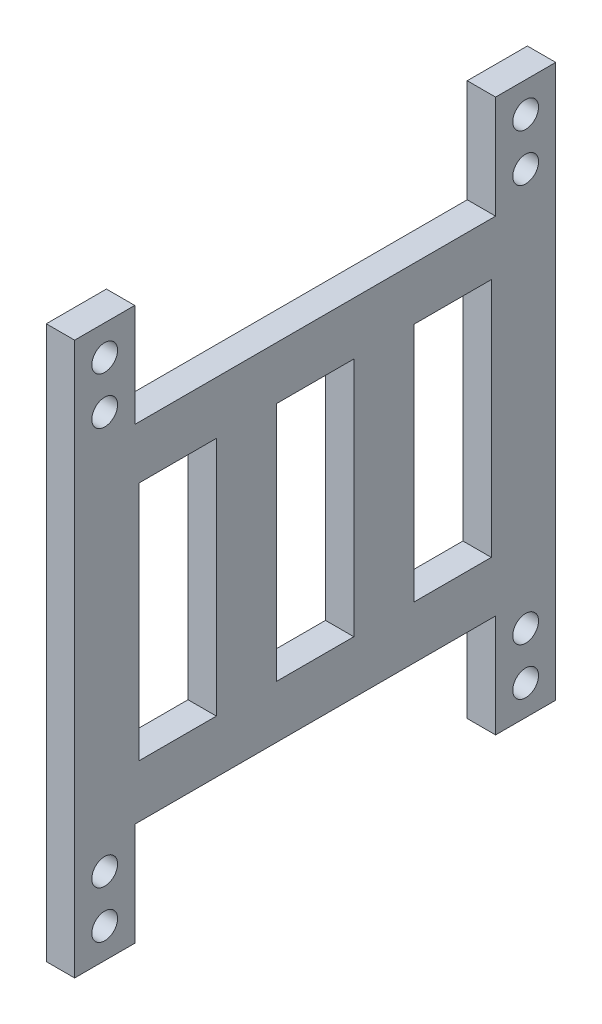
ISO-10303-21;
HEADER;
FILE_DESCRIPTION(('STEP AP214'),'2;1');
FILE_NAME('part.step','',(''),(''),'','','');
FILE_SCHEMA(('AUTOMOTIVE_DESIGN { 1 0 10303 214 1 1 1 1 }'));
ENDSEC;
DATA;
#1=APPLICATION_CONTEXT('core data for automotive mechanical design processes');
#2=APPLICATION_PROTOCOL_DEFINITION('international standard','automotive_design',2000,#1);
#3=PRODUCT_CONTEXT('',#1,'mechanical');
#4=PRODUCT('Part','Part','',(#3));
#5=PRODUCT_RELATED_PRODUCT_CATEGORY('part','',(#4));
#6=PRODUCT_DEFINITION_FORMATION('','',#4);
#7=PRODUCT_DEFINITION_CONTEXT('part definition',#1,'design');
#8=PRODUCT_DEFINITION('design','',#6,#7);
#9=PRODUCT_DEFINITION_SHAPE('','',#8);
#10=(LENGTH_UNIT() NAMED_UNIT(*) SI_UNIT(.MILLI.,.METRE.));
#11=(NAMED_UNIT(*) PLANE_ANGLE_UNIT() SI_UNIT($,.RADIAN.));
#12=(NAMED_UNIT(*) SI_UNIT($,.STERADIAN.) SOLID_ANGLE_UNIT());
#13=UNCERTAINTY_MEASURE_WITH_UNIT(LENGTH_MEASURE(1.E-05),#10,'distance_accuracy_value','');
#14=(GEOMETRIC_REPRESENTATION_CONTEXT(3) GLOBAL_UNCERTAINTY_ASSIGNED_CONTEXT((#13)) GLOBAL_UNIT_ASSIGNED_CONTEXT((#10,
#11,#12)) REPRESENTATION_CONTEXT('',''));
#15=CARTESIAN_POINT('',(0.,0.,0.));
#16=DIRECTION('',(0.,0.,1.));
#17=DIRECTION('',(1.,0.,0.));
#18=AXIS2_PLACEMENT_3D('',#15,#16,#17);
#19=CARTESIAN_POINT('',(3.3,-32.1500000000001,0.));
#20=DIRECTION('',(0.,-1.,0.));
#21=DIRECTION('',(0.,0.,-1.));
#22=AXIS2_PLACEMENT_3D('',#19,#20,#21);
#23=PLANE('',#22);
#24=DIRECTION('',(0.,0.,1.));
#25=VECTOR('',#24,1.);
#26=CARTESIAN_POINT('',(0.,-32.1500000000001,0.));
#27=LINE('',#26,#25);
#28=CARTESIAN_POINT('',(0.,-32.15,-28.));
#29=VERTEX_POINT('',#28);
#30=CARTESIAN_POINT('',(0.,-32.15,-21.));
#31=VERTEX_POINT('',#30);
#32=EDGE_CURVE('E264',#29,#31,#27,.T.);
#33=ORIENTED_EDGE('',*,*,#32,.F.);
#34=DIRECTION('',(-1.,0.,0.));
#35=VECTOR('',#34,1.);
#36=CARTESIAN_POINT('',(3.3,-32.15,-28.));
#37=LINE('',#36,#35);
#38=CARTESIAN_POINT('',(3.3,-32.15,-28.));
#39=VERTEX_POINT('',#38);
#40=EDGE_CURVE('E406',#39,#29,#37,.T.);
#41=ORIENTED_EDGE('',*,*,#40,.F.);
#42=DIRECTION('',(0.,0.,1.));
#43=VECTOR('',#42,1.);
#44=CARTESIAN_POINT('',(3.3,-32.1500000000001,0.));
#45=LINE('',#44,#43);
#46=CARTESIAN_POINT('',(3.3,-32.15,-21.));
#47=VERTEX_POINT('',#46);
#48=EDGE_CURVE('E271',#39,#47,#45,.T.);
#49=ORIENTED_EDGE('',*,*,#48,.T.);
#50=DIRECTION('',(-1.,0.,0.));
#51=VECTOR('',#50,1.);
#52=CARTESIAN_POINT('',(3.3,-32.15,-21.));
#53=LINE('',#52,#51);
#54=EDGE_CURVE('E326',#47,#31,#53,.T.);
#55=ORIENTED_EDGE('',*,*,#54,.T.);
#56=EDGE_LOOP('',(#33,#41,#49,#55));
#57=FACE_BOUND('',#56,.T.);
#58=ADVANCED_FACE('F39',(#57),#23,.T.);
#59=CARTESIAN_POINT('',(3.3,0.,-28.));
#60=DIRECTION('',(0.,0.,1.));
#61=DIRECTION('',(1.,0.,0.));
#62=AXIS2_PLACEMENT_3D('',#59,#60,#61);
#63=PLANE('',#62);
#64=DIRECTION('',(0.,1.,0.));
#65=VECTOR('',#64,1.);
#66=CARTESIAN_POINT('',(0.,0.,-28.));
#67=LINE('',#66,#65);
#68=CARTESIAN_POINT('',(0.,32.15,-28.));
#69=VERTEX_POINT('',#68);
#70=EDGE_CURVE('E329',#29,#69,#67,.T.);
#71=ORIENTED_EDGE('',*,*,#70,.T.);
#72=DIRECTION('',(-1.,0.,0.));
#73=VECTOR('',#72,1.);
#74=CARTESIAN_POINT('',(3.3,32.15,-28.));
#75=LINE('',#74,#73);
#76=CARTESIAN_POINT('',(3.3,32.15,-28.));
#77=VERTEX_POINT('',#76);
#78=EDGE_CURVE('E403',#77,#69,#75,.T.);
#79=ORIENTED_EDGE('',*,*,#78,.F.);
#80=DIRECTION('',(0.,1.,0.));
#81=VECTOR('',#80,1.);
#82=CARTESIAN_POINT('',(3.3,0.,-28.));
#83=LINE('',#82,#81);
#84=EDGE_CURVE('E274',#39,#77,#83,.T.);
#85=ORIENTED_EDGE('',*,*,#84,.F.);
#86=ORIENTED_EDGE('',*,*,#40,.T.);
#87=EDGE_LOOP('',(#71,#79,#85,#86));
#88=FACE_BOUND('',#87,.T.);
#89=ADVANCED_FACE('F463',(#88),#63,.F.);
#90=CARTESIAN_POINT('',(3.3,32.15,0.));
#91=DIRECTION('',(0.,-1.,0.));
#92=DIRECTION('',(0.,0.,-1.));
#93=AXIS2_PLACEMENT_3D('',#90,#91,#92);
#94=PLANE('',#93);
#95=DIRECTION('',(0.,0.,1.));
#96=VECTOR('',#95,1.);
#97=CARTESIAN_POINT('',(0.,32.15,0.));
#98=LINE('',#97,#96);
#99=CARTESIAN_POINT('',(0.,32.15,-21.));
#100=VERTEX_POINT('',#99);
#101=EDGE_CURVE('E331',#69,#100,#98,.T.);
#102=ORIENTED_EDGE('',*,*,#101,.T.);
#103=DIRECTION('',(-1.,0.,0.));
#104=VECTOR('',#103,1.);
#105=CARTESIAN_POINT('',(3.3,32.15,-21.));
#106=LINE('',#105,#104);
#107=CARTESIAN_POINT('',(3.3,32.15,-21.));
#108=VERTEX_POINT('',#107);
#109=EDGE_CURVE('E401',#108,#100,#106,.T.);
#110=ORIENTED_EDGE('',*,*,#109,.F.);
#111=DIRECTION('',(0.,0.,1.));
#112=VECTOR('',#111,1.);
#113=CARTESIAN_POINT('',(3.3,32.15,0.));
#114=LINE('',#113,#112);
#115=EDGE_CURVE('E277',#77,#108,#114,.T.);
#116=ORIENTED_EDGE('',*,*,#115,.F.);
#117=ORIENTED_EDGE('',*,*,#78,.T.);
#118=EDGE_LOOP('',(#102,#110,#116,#117));
#119=FACE_BOUND('',#118,.T.);
#120=ADVANCED_FACE('F468',(#119),#94,.F.);
#121=CARTESIAN_POINT('',(3.3,0.,-21.));
#122=DIRECTION('',(0.,0.,1.));
#123=DIRECTION('',(1.,0.,0.));
#124=AXIS2_PLACEMENT_3D('',#121,#122,#123);
#125=PLANE('',#124);
#126=DIRECTION('',(0.,1.,0.));
#127=VECTOR('',#126,1.);
#128=CARTESIAN_POINT('',(0.,0.,-21.));
#129=LINE('',#128,#127);
#130=CARTESIAN_POINT('',(0.,20.15,-21.));
#131=VERTEX_POINT('',#130);
#132=EDGE_CURVE('E334',#131,#100,#129,.T.);
#133=ORIENTED_EDGE('',*,*,#132,.F.);
#134=DIRECTION('',(-1.,0.,0.));
#135=VECTOR('',#134,1.);
#136=CARTESIAN_POINT('',(3.3,20.15,-21.));
#137=LINE('',#136,#135);
#138=CARTESIAN_POINT('',(3.3,20.15,-21.));
#139=VERTEX_POINT('',#138);
#140=EDGE_CURVE('E399',#139,#131,#137,.T.);
#141=ORIENTED_EDGE('',*,*,#140,.F.);
#142=DIRECTION('',(0.,1.,0.));
#143=VECTOR('',#142,1.);
#144=CARTESIAN_POINT('',(3.3,0.,-21.));
#145=LINE('',#144,#143);
#146=EDGE_CURVE('E279',#139,#108,#145,.T.);
#147=ORIENTED_EDGE('',*,*,#146,.T.);
#148=ORIENTED_EDGE('',*,*,#109,.T.);
#149=EDGE_LOOP('',(#133,#141,#147,#148));
#150=FACE_BOUND('',#149,.T.);
#151=ADVANCED_FACE('F521',(#150),#125,.T.);
#152=CARTESIAN_POINT('',(3.3,20.15,0.));
#153=DIRECTION('',(0.,1.,0.));
#154=DIRECTION('',(0.,0.,1.));
#155=AXIS2_PLACEMENT_3D('',#152,#153,#154);
#156=PLANE('',#155);
#157=DIRECTION('',(0.,0.,-1.));
#158=VECTOR('',#157,1.);
#159=CARTESIAN_POINT('',(0.,20.15,0.));
#160=LINE('',#159,#158);
#161=CARTESIAN_POINT('',(0.,20.15,21.));
#162=VERTEX_POINT('',#161);
#163=EDGE_CURVE('E337',#162,#131,#160,.T.);
#164=ORIENTED_EDGE('',*,*,#163,.F.);
#165=DIRECTION('',(-1.,0.,0.));
#166=VECTOR('',#165,1.);
#167=CARTESIAN_POINT('',(3.3,20.15,21.));
#168=LINE('',#167,#166);
#169=CARTESIAN_POINT('',(3.3,20.15,21.));
#170=VERTEX_POINT('',#169);
#171=EDGE_CURVE('E397',#170,#162,#168,.T.);
#172=ORIENTED_EDGE('',*,*,#171,.F.);
#173=DIRECTION('',(0.,0.,-1.));
#174=VECTOR('',#173,1.);
#175=CARTESIAN_POINT('',(3.3,20.15,0.));
#176=LINE('',#175,#174);
#177=EDGE_CURVE('E282',#170,#139,#176,.T.);
#178=ORIENTED_EDGE('',*,*,#177,.T.);
#179=ORIENTED_EDGE('',*,*,#140,.T.);
#180=EDGE_LOOP('',(#164,#172,#178,#179));
#181=FACE_BOUND('',#180,.T.);
#182=ADVANCED_FACE('F517',(#181),#156,.T.);
#183=CARTESIAN_POINT('',(3.3,0.,21.));
#184=DIRECTION('',(0.,0.,1.));
#185=DIRECTION('',(1.,0.,0.));
#186=AXIS2_PLACEMENT_3D('',#183,#184,#185);
#187=PLANE('',#186);
#188=DIRECTION('',(0.,1.,0.));
#189=VECTOR('',#188,1.);
#190=CARTESIAN_POINT('',(0.,0.,21.));
#191=LINE('',#190,#189);
#192=CARTESIAN_POINT('',(0.,32.15,21.));
#193=VERTEX_POINT('',#192);
#194=EDGE_CURVE('E340',#162,#193,#191,.T.);
#195=ORIENTED_EDGE('',*,*,#194,.T.);
#196=DIRECTION('',(-1.,0.,0.));
#197=VECTOR('',#196,1.);
#198=CARTESIAN_POINT('',(3.3,32.15,21.));
#199=LINE('',#198,#197);
#200=CARTESIAN_POINT('',(3.3,32.15,21.));
#201=VERTEX_POINT('',#200);
#202=EDGE_CURVE('E395',#201,#193,#199,.T.);
#203=ORIENTED_EDGE('',*,*,#202,.F.);
#204=DIRECTION('',(0.,1.,0.));
#205=VECTOR('',#204,1.);
#206=CARTESIAN_POINT('',(3.3,0.,21.));
#207=LINE('',#206,#205);
#208=EDGE_CURVE('E285',#170,#201,#207,.T.);
#209=ORIENTED_EDGE('',*,*,#208,.F.);
#210=ORIENTED_EDGE('',*,*,#171,.T.);
#211=EDGE_LOOP('',(#195,#203,#209,#210));
#212=FACE_BOUND('',#211,.T.);
#213=ADVANCED_FACE('F528',(#212),#187,.F.);
#214=CARTESIAN_POINT('',(3.3,32.15,0.));
#215=DIRECTION('',(0.,1.,0.));
#216=DIRECTION('',(0.,0.,1.));
#217=AXIS2_PLACEMENT_3D('',#214,#215,#216);
#218=PLANE('',#217);
#219=DIRECTION('',(0.,0.,-1.));
#220=VECTOR('',#219,1.);
#221=CARTESIAN_POINT('',(0.,32.15,0.));
#222=LINE('',#221,#220);
#223=CARTESIAN_POINT('',(0.,32.15,28.));
#224=VERTEX_POINT('',#223);
#225=EDGE_CURVE('E343',#224,#193,#222,.T.);
#226=ORIENTED_EDGE('',*,*,#225,.F.);
#227=DIRECTION('',(-1.,0.,0.));
#228=VECTOR('',#227,1.);
#229=CARTESIAN_POINT('',(3.3,32.15,28.));
#230=LINE('',#229,#228);
#231=CARTESIAN_POINT('',(3.3,32.15,28.));
#232=VERTEX_POINT('',#231);
#233=EDGE_CURVE('E393',#232,#224,#230,.T.);
#234=ORIENTED_EDGE('',*,*,#233,.F.);
#235=DIRECTION('',(0.,0.,-1.));
#236=VECTOR('',#235,1.);
#237=CARTESIAN_POINT('',(3.3,32.15,0.));
#238=LINE('',#237,#236);
#239=EDGE_CURVE('E287',#232,#201,#238,.T.);
#240=ORIENTED_EDGE('',*,*,#239,.T.);
#241=ORIENTED_EDGE('',*,*,#202,.T.);
#242=EDGE_LOOP('',(#226,#234,#240,#241));
#243=FACE_BOUND('',#242,.T.);
#244=ADVANCED_FACE('F511',(#243),#218,.T.);
#245=CARTESIAN_POINT('',(3.3,0.,28.));
#246=DIRECTION('',(0.,0.,1.));
#247=DIRECTION('',(0.,-1.,0.));
#248=AXIS2_PLACEMENT_3D('',#245,#246,#247);
#249=PLANE('',#248);
#250=DIRECTION('',(0.,1.,0.));
#251=VECTOR('',#250,1.);
#252=CARTESIAN_POINT('',(0.,0.,28.));
#253=LINE('',#252,#251);
#254=CARTESIAN_POINT('',(0.,-32.15,28.));
#255=VERTEX_POINT('',#254);
#256=EDGE_CURVE('E346',#255,#224,#253,.T.);
#257=ORIENTED_EDGE('',*,*,#256,.F.);
#258=DIRECTION('',(-1.,0.,0.));
#259=VECTOR('',#258,1.);
#260=CARTESIAN_POINT('',(3.3,-32.15,28.));
#261=LINE('',#260,#259);
#262=CARTESIAN_POINT('',(3.3,-32.15,28.));
#263=VERTEX_POINT('',#262);
#264=EDGE_CURVE('E391',#263,#255,#261,.T.);
#265=ORIENTED_EDGE('',*,*,#264,.F.);
#266=DIRECTION('',(0.,1.,0.));
#267=VECTOR('',#266,1.);
#268=CARTESIAN_POINT('',(3.3,0.,28.));
#269=LINE('',#268,#267);
#270=EDGE_CURVE('E290',#263,#232,#269,.T.);
#271=ORIENTED_EDGE('',*,*,#270,.T.);
#272=ORIENTED_EDGE('',*,*,#233,.T.);
#273=EDGE_LOOP('',(#257,#265,#271,#272));
#274=FACE_BOUND('',#273,.T.);
#275=ADVANCED_FACE('F506',(#274),#249,.T.);
#276=CARTESIAN_POINT('',(3.3,-32.15,0.));
#277=DIRECTION('',(0.,1.,0.));
#278=DIRECTION('',(0.,0.,1.));
#279=AXIS2_PLACEMENT_3D('',#276,#277,#278);
#280=PLANE('',#279);
#281=DIRECTION('',(0.,0.,-1.));
#282=VECTOR('',#281,1.);
#283=CARTESIAN_POINT('',(0.,-32.15,0.));
#284=LINE('',#283,#282);
#285=CARTESIAN_POINT('',(0.,-32.15,21.));
#286=VERTEX_POINT('',#285);
#287=EDGE_CURVE('E349',#255,#286,#284,.T.);
#288=ORIENTED_EDGE('',*,*,#287,.T.);
#289=DIRECTION('',(-1.,0.,0.));
#290=VECTOR('',#289,1.);
#291=CARTESIAN_POINT('',(3.3,-32.15,21.));
#292=LINE('',#291,#290);
#293=CARTESIAN_POINT('',(3.3,-32.15,21.));
#294=VERTEX_POINT('',#293);
#295=EDGE_CURVE('E389',#294,#286,#292,.T.);
#296=ORIENTED_EDGE('',*,*,#295,.F.);
#297=DIRECTION('',(0.,0.,-1.));
#298=VECTOR('',#297,1.);
#299=CARTESIAN_POINT('',(3.3,-32.15,0.));
#300=LINE('',#299,#298);
#301=EDGE_CURVE('E293',#263,#294,#300,.T.);
#302=ORIENTED_EDGE('',*,*,#301,.F.);
#303=ORIENTED_EDGE('',*,*,#264,.T.);
#304=EDGE_LOOP('',(#288,#296,#302,#303));
#305=FACE_BOUND('',#304,.T.);
#306=ADVANCED_FACE('F503',(#305),#280,.F.);
#307=CARTESIAN_POINT('',(3.3,0.,21.));
#308=DIRECTION('',(0.,0.,-1.));
#309=DIRECTION('',(0.,1.,0.));
#310=AXIS2_PLACEMENT_3D('',#307,#308,#309);
#311=PLANE('',#310);
#312=DIRECTION('',(0.,-1.,0.));
#313=VECTOR('',#312,1.);
#314=CARTESIAN_POINT('',(0.,0.,21.));
#315=LINE('',#314,#313);
#316=CARTESIAN_POINT('',(0.,-20.15,21.));
#317=VERTEX_POINT('',#316);
#318=EDGE_CURVE('E352',#317,#286,#315,.T.);
#319=ORIENTED_EDGE('',*,*,#318,.F.);
#320=DIRECTION('',(-1.,0.,0.));
#321=VECTOR('',#320,1.);
#322=CARTESIAN_POINT('',(3.3,-20.15,21.));
#323=LINE('',#322,#321);
#324=CARTESIAN_POINT('',(3.3,-20.15,21.));
#325=VERTEX_POINT('',#324);
#326=EDGE_CURVE('E387',#325,#317,#323,.T.);
#327=ORIENTED_EDGE('',*,*,#326,.F.);
#328=DIRECTION('',(0.,-1.,0.));
#329=VECTOR('',#328,1.);
#330=CARTESIAN_POINT('',(3.3,0.,21.));
#331=LINE('',#330,#329);
#332=EDGE_CURVE('E295',#325,#294,#331,.T.);
#333=ORIENTED_EDGE('',*,*,#332,.T.);
#334=ORIENTED_EDGE('',*,*,#295,.T.);
#335=EDGE_LOOP('',(#319,#327,#333,#334));
#336=FACE_BOUND('',#335,.T.);
#337=ADVANCED_FACE('F499',(#336),#311,.T.);
#338=CARTESIAN_POINT('',(3.3,-20.15,0.));
#339=DIRECTION('',(0.,1.,0.));
#340=DIRECTION('',(0.,0.,1.));
#341=AXIS2_PLACEMENT_3D('',#338,#339,#340);
#342=PLANE('',#341);
#343=DIRECTION('',(0.,0.,-1.));
#344=VECTOR('',#343,1.);
#345=CARTESIAN_POINT('',(0.,-20.15,0.));
#346=LINE('',#345,#344);
#347=CARTESIAN_POINT('',(0.,-20.15,-21.));
#348=VERTEX_POINT('',#347);
#349=EDGE_CURVE('E355',#317,#348,#346,.T.);
#350=ORIENTED_EDGE('',*,*,#349,.T.);
#351=DIRECTION('',(-1.,0.,0.));
#352=VECTOR('',#351,1.);
#353=CARTESIAN_POINT('',(3.3,-20.15,-21.));
#354=LINE('',#353,#352);
#355=CARTESIAN_POINT('',(3.3,-20.15,-21.));
#356=VERTEX_POINT('',#355);
#357=EDGE_CURVE('E384',#356,#348,#354,.T.);
#358=ORIENTED_EDGE('',*,*,#357,.F.);
#359=DIRECTION('',(0.,0.,-1.));
#360=VECTOR('',#359,1.);
#361=CARTESIAN_POINT('',(3.3,-20.15,0.));
#362=LINE('',#361,#360);
#363=EDGE_CURVE('E298',#325,#356,#362,.T.);
#364=ORIENTED_EDGE('',*,*,#363,.F.);
#365=ORIENTED_EDGE('',*,*,#326,.T.);
#366=EDGE_LOOP('',(#350,#358,#364,#365));
#367=FACE_BOUND('',#366,.T.);
#368=ADVANCED_FACE('F495',(#367),#342,.F.);
#369=CARTESIAN_POINT('',(3.3,-28.65,-24.5));
#370=DIRECTION('',(-1.,0.,0.));
#371=DIRECTION('',(0.,0.,1.));
#372=AXIS2_PLACEMENT_3D('',#369,#370,#371);
#373=CYLINDRICAL_SURFACE('',#372,1.5);
#374=CARTESIAN_POINT('',(3.3,-28.65,-24.5));
#375=DIRECTION('',(1.,0.,0.));
#376=DIRECTION('',(0.,0.,-1.));
#377=AXIS2_PLACEMENT_3D('',#374,#375,#376);
#378=CIRCLE('',#377,1.5);
#379=CARTESIAN_POINT('',(3.3,-28.65,-26.));
#380=VERTEX_POINT('',#379);
#381=EDGE_CURVE('E320',#380,#380,#378,.T.);
#382=ORIENTED_EDGE('',*,*,#381,.T.);
#383=EDGE_LOOP('',(#382));
#384=FACE_BOUND('',#383,.T.);
#385=CARTESIAN_POINT('',(0.,-28.65,-24.5));
#386=DIRECTION('',(1.,0.,0.));
#387=DIRECTION('',(0.,0.,-1.));
#388=AXIS2_PLACEMENT_3D('',#385,#386,#387);
#389=CIRCLE('',#388,1.5);
#390=CARTESIAN_POINT('',(0.,-28.65,-26.));
#391=VERTEX_POINT('',#390);
#392=EDGE_CURVE('E378',#391,#391,#389,.T.);
#393=ORIENTED_EDGE('',*,*,#392,.F.);
#394=EDGE_LOOP('',(#393));
#395=FACE_BOUND('',#394,.T.);
#396=ADVANCED_FACE('F544',(#384,#395),#373,.F.);
#397=CARTESIAN_POINT('',(3.3,28.65,-24.5));
#398=DIRECTION('',(-1.,0.,0.));
#399=DIRECTION('',(0.,0.,1.));
#400=AXIS2_PLACEMENT_3D('',#397,#398,#399);
#401=CYLINDRICAL_SURFACE('',#400,1.5);
#402=CARTESIAN_POINT('',(3.3,28.65,-24.5));
#403=DIRECTION('',(1.,0.,0.));
#404=DIRECTION('',(0.,0.,-1.));
#405=AXIS2_PLACEMENT_3D('',#402,#403,#404);
#406=CIRCLE('',#405,1.5);
#407=CARTESIAN_POINT('',(3.3,28.65,-26.));
#408=VERTEX_POINT('',#407);
#409=EDGE_CURVE('E317',#408,#408,#406,.F.);
#410=ORIENTED_EDGE('',*,*,#409,.F.);
#411=EDGE_LOOP('',(#410));
#412=FACE_BOUND('',#411,.T.);
#413=CARTESIAN_POINT('',(0.,28.65,-24.5));
#414=DIRECTION('',(1.,0.,0.));
#415=DIRECTION('',(0.,0.,-1.));
#416=AXIS2_PLACEMENT_3D('',#413,#414,#415);
#417=CIRCLE('',#416,1.5);
#418=CARTESIAN_POINT('',(0.,28.65,-26.));
#419=VERTEX_POINT('',#418);
#420=EDGE_CURVE('E375',#419,#419,#417,.F.);
#421=ORIENTED_EDGE('',*,*,#420,.T.);
#422=EDGE_LOOP('',(#421));
#423=FACE_BOUND('',#422,.T.);
#424=ADVANCED_FACE('F567',(#412,#423),#401,.F.);
#425=CARTESIAN_POINT('',(3.3,23.15,-24.5));
#426=DIRECTION('',(-1.,0.,0.));
#427=DIRECTION('',(0.,0.,1.));
#428=AXIS2_PLACEMENT_3D('',#425,#426,#427);
#429=CYLINDRICAL_SURFACE('',#428,1.5);
#430=CARTESIAN_POINT('',(3.3,23.15,-24.5));
#431=DIRECTION('',(1.,0.,0.));
#432=DIRECTION('',(0.,0.,-1.));
#433=AXIS2_PLACEMENT_3D('',#430,#431,#432);
#434=CIRCLE('',#433,1.5);
#435=CARTESIAN_POINT('',(3.3,23.15,-26.));
#436=VERTEX_POINT('',#435);
#437=EDGE_CURVE('E314',#436,#436,#434,.F.);
#438=ORIENTED_EDGE('',*,*,#437,.F.);
#439=EDGE_LOOP('',(#438));
#440=FACE_BOUND('',#439,.T.);
#441=CARTESIAN_POINT('',(0.,23.15,-24.5));
#442=DIRECTION('',(1.,0.,0.));
#443=DIRECTION('',(0.,0.,-1.));
#444=AXIS2_PLACEMENT_3D('',#441,#442,#443);
#445=CIRCLE('',#444,1.5);
#446=CARTESIAN_POINT('',(0.,23.15,-26.));
#447=VERTEX_POINT('',#446);
#448=EDGE_CURVE('E372',#447,#447,#445,.F.);
#449=ORIENTED_EDGE('',*,*,#448,.T.);
#450=EDGE_LOOP('',(#449));
#451=FACE_BOUND('',#450,.T.);
#452=ADVANCED_FACE('F563',(#440,#451),#429,.F.);
#453=CARTESIAN_POINT('',(3.3,-28.65,24.5));
#454=DIRECTION('',(-1.,0.,0.));
#455=DIRECTION('',(0.,0.,1.));
#456=AXIS2_PLACEMENT_3D('',#453,#454,#455);
#457=CYLINDRICAL_SURFACE('',#456,1.5);
#458=CARTESIAN_POINT('',(3.3,-28.65,24.5));
#459=DIRECTION('',(1.,0.,0.));
#460=DIRECTION('',(0.,0.,-1.));
#461=AXIS2_PLACEMENT_3D('',#458,#459,#460);
#462=CIRCLE('',#461,1.5);
#463=CARTESIAN_POINT('',(3.3,-28.65,23.));
#464=VERTEX_POINT('',#463);
#465=EDGE_CURVE('E311',#464,#464,#462,.F.);
#466=ORIENTED_EDGE('',*,*,#465,.F.);
#467=EDGE_LOOP('',(#466));
#468=FACE_BOUND('',#467,.T.);
#469=CARTESIAN_POINT('',(0.,-28.65,24.5));
#470=DIRECTION('',(1.,0.,0.));
#471=DIRECTION('',(0.,0.,-1.));
#472=AXIS2_PLACEMENT_3D('',#469,#470,#471);
#473=CIRCLE('',#472,1.5);
#474=CARTESIAN_POINT('',(0.,-28.65,23.));
#475=VERTEX_POINT('',#474);
#476=EDGE_CURVE('E369',#475,#475,#473,.F.);
#477=ORIENTED_EDGE('',*,*,#476,.T.);
#478=EDGE_LOOP('',(#477));
#479=FACE_BOUND('',#478,.T.);
#480=ADVANCED_FACE('F559',(#468,#479),#457,.F.);
#481=CARTESIAN_POINT('',(3.3,-23.15,24.5));
#482=DIRECTION('',(-1.,0.,0.));
#483=DIRECTION('',(0.,0.,1.));
#484=AXIS2_PLACEMENT_3D('',#481,#482,#483);
#485=CYLINDRICAL_SURFACE('',#484,1.5);
#486=CARTESIAN_POINT('',(3.3,-23.15,24.5));
#487=DIRECTION('',(1.,0.,0.));
#488=DIRECTION('',(0.,0.,-1.));
#489=AXIS2_PLACEMENT_3D('',#486,#487,#488);
#490=CIRCLE('',#489,1.5);
#491=CARTESIAN_POINT('',(3.3,-23.15,23.));
#492=VERTEX_POINT('',#491);
#493=EDGE_CURVE('E308',#492,#492,#490,.F.);
#494=ORIENTED_EDGE('',*,*,#493,.F.);
#495=EDGE_LOOP('',(#494));
#496=FACE_BOUND('',#495,.T.);
#497=CARTESIAN_POINT('',(0.,-23.15,24.5));
#498=DIRECTION('',(1.,0.,0.));
#499=DIRECTION('',(0.,0.,-1.));
#500=AXIS2_PLACEMENT_3D('',#497,#498,#499);
#501=CIRCLE('',#500,1.5);
#502=CARTESIAN_POINT('',(0.,-23.15,23.));
#503=VERTEX_POINT('',#502);
#504=EDGE_CURVE('E366',#503,#503,#501,.F.);
#505=ORIENTED_EDGE('',*,*,#504,.T.);
#506=EDGE_LOOP('',(#505));
#507=FACE_BOUND('',#506,.T.);
#508=ADVANCED_FACE('F555',(#496,#507),#485,.F.);
#509=CARTESIAN_POINT('',(3.3,28.65,24.5));
#510=DIRECTION('',(-1.,0.,0.));
#511=DIRECTION('',(0.,0.,1.));
#512=AXIS2_PLACEMENT_3D('',#509,#510,#511);
#513=CYLINDRICAL_SURFACE('',#512,1.5);
#514=CARTESIAN_POINT('',(3.3,28.65,24.5));
#515=DIRECTION('',(1.,0.,0.));
#516=DIRECTION('',(0.,0.,-1.));
#517=AXIS2_PLACEMENT_3D('',#514,#515,#516);
#518=CIRCLE('',#517,1.5);
#519=CARTESIAN_POINT('',(3.3,28.65,23.));
#520=VERTEX_POINT('',#519);
#521=EDGE_CURVE('E305',#520,#520,#518,.T.);
#522=ORIENTED_EDGE('',*,*,#521,.T.);
#523=EDGE_LOOP('',(#522));
#524=FACE_BOUND('',#523,.T.);
#525=CARTESIAN_POINT('',(0.,28.65,24.5));
#526=DIRECTION('',(1.,0.,0.));
#527=DIRECTION('',(0.,0.,-1.));
#528=AXIS2_PLACEMENT_3D('',#525,#526,#527);
#529=CIRCLE('',#528,1.5);
#530=CARTESIAN_POINT('',(0.,28.65,23.));
#531=VERTEX_POINT('',#530);
#532=EDGE_CURVE('E363',#531,#531,#529,.T.);
#533=ORIENTED_EDGE('',*,*,#532,.F.);
#534=EDGE_LOOP('',(#533));
#535=FACE_BOUND('',#534,.T.);
#536=ADVANCED_FACE('F551',(#524,#535),#513,.F.);
#537=CARTESIAN_POINT('',(3.3,23.15,24.5));
#538=DIRECTION('',(-1.,0.,0.));
#539=DIRECTION('',(0.,0.,1.));
#540=AXIS2_PLACEMENT_3D('',#537,#538,#539);
#541=CYLINDRICAL_SURFACE('',#540,1.5);
#542=CARTESIAN_POINT('',(3.3,23.15,24.5));
#543=DIRECTION('',(1.,0.,0.));
#544=DIRECTION('',(0.,0.,-1.));
#545=AXIS2_PLACEMENT_3D('',#542,#543,#544);
#546=CIRCLE('',#545,1.5);
#547=CARTESIAN_POINT('',(3.3,23.15,23.));
#548=VERTEX_POINT('',#547);
#549=EDGE_CURVE('E302',#548,#548,#546,.T.);
#550=ORIENTED_EDGE('',*,*,#549,.T.);
#551=EDGE_LOOP('',(#550));
#552=FACE_BOUND('',#551,.T.);
#553=CARTESIAN_POINT('',(0.,23.15,24.5));
#554=DIRECTION('',(1.,0.,0.));
#555=DIRECTION('',(0.,0.,-1.));
#556=AXIS2_PLACEMENT_3D('',#553,#554,#555);
#557=CIRCLE('',#556,1.5);
#558=CARTESIAN_POINT('',(0.,23.15,23.));
#559=VERTEX_POINT('',#558);
#560=EDGE_CURVE('E360',#559,#559,#557,.T.);
#561=ORIENTED_EDGE('',*,*,#560,.F.);
#562=EDGE_LOOP('',(#561));
#563=FACE_BOUND('',#562,.T.);
#564=ADVANCED_FACE('F548',(#552,#563),#541,.F.);
#565=CARTESIAN_POINT('',(3.3,0.,-21.));
#566=DIRECTION('',(0.,0.,-1.));
#567=DIRECTION('',(-1.,0.,0.));
#568=AXIS2_PLACEMENT_3D('',#565,#566,#567);
#569=PLANE('',#568);
#570=DIRECTION('',(0.,-1.,0.));
#571=VECTOR('',#570,1.);
#572=CARTESIAN_POINT('',(0.,0.,-21.));
#573=LINE('',#572,#571);
#574=EDGE_CURVE('E357',#348,#31,#573,.T.);
#575=ORIENTED_EDGE('',*,*,#574,.T.);
#576=ORIENTED_EDGE('',*,*,#54,.F.);
#577=DIRECTION('',(0.,-1.,0.));
#578=VECTOR('',#577,1.);
#579=CARTESIAN_POINT('',(3.3,0.,-21.));
#580=LINE('',#579,#578);
#581=EDGE_CURVE('E300',#356,#47,#580,.T.);
#582=ORIENTED_EDGE('',*,*,#581,.F.);
#583=ORIENTED_EDGE('',*,*,#357,.T.);
#584=EDGE_LOOP('',(#575,#576,#582,#583));
#585=FACE_BOUND('',#584,.T.);
#586=ADVANCED_FACE('F493',(#585),#569,.F.);
#587=CARTESIAN_POINT('',(3.3,-23.15,-24.5));
#588=DIRECTION('',(-1.,0.,0.));
#589=DIRECTION('',(0.,0.,1.));
#590=AXIS2_PLACEMENT_3D('',#587,#588,#589);
#591=CYLINDRICAL_SURFACE('',#590,1.5);
#592=CARTESIAN_POINT('',(3.3,-23.15,-24.5));
#593=DIRECTION('',(1.,0.,0.));
#594=DIRECTION('',(0.,0.,-1.));
#595=AXIS2_PLACEMENT_3D('',#592,#593,#594);
#596=CIRCLE('',#595,1.5);
#597=CARTESIAN_POINT('',(3.3,-23.15,-26.));
#598=VERTEX_POINT('',#597);
#599=EDGE_CURVE('E323',#598,#598,#596,.T.);
#600=ORIENTED_EDGE('',*,*,#599,.T.);
#601=EDGE_LOOP('',(#600));
#602=FACE_BOUND('',#601,.T.);
#603=CARTESIAN_POINT('',(0.,-23.15,-24.5));
#604=DIRECTION('',(1.,0.,0.));
#605=DIRECTION('',(0.,0.,-1.));
#606=AXIS2_PLACEMENT_3D('',#603,#604,#605);
#607=CIRCLE('',#606,1.5);
#608=CARTESIAN_POINT('',(0.,-23.15,-26.));
#609=VERTEX_POINT('',#608);
#610=EDGE_CURVE('E275',#609,#609,#607,.T.);
#611=ORIENTED_EDGE('',*,*,#610,.F.);
#612=EDGE_LOOP('',(#611));
#613=FACE_BOUND('',#612,.T.);
#614=ADVANCED_FACE('F547',(#602,#613),#591,.F.);
#615=CARTESIAN_POINT('',(3.3,0.,0.));
#616=DIRECTION('',(1.,0.,0.));
#617=DIRECTION('',(0.,0.,-1.));
#618=AXIS2_PLACEMENT_3D('',#615,#616,#617);
#619=PLANE('',#618);
#620=DIRECTION('',(0.,1.,0.));
#621=VECTOR('',#620,1.);
#622=CARTESIAN_POINT('',(3.3,-14.,-20.5));
#623=LINE('',#622,#621);
#624=CARTESIAN_POINT('',(3.3,-14.,-20.5));
#625=VERTEX_POINT('',#624);
#626=CARTESIAN_POINT('',(3.3,14.,-20.5));
#627=VERTEX_POINT('',#626);
#628=EDGE_CURVE('E53',#625,#627,#623,.T.);
#629=ORIENTED_EDGE('',*,*,#628,.F.);
#630=DIRECTION('',(0.,0.,-1.));
#631=VECTOR('',#630,1.);
#632=CARTESIAN_POINT('',(3.3,-14.,-11.5));
#633=LINE('',#632,#631);
#634=CARTESIAN_POINT('',(3.3,-14.,-11.5));
#635=VERTEX_POINT('',#634);
#636=EDGE_CURVE('E240',#635,#625,#633,.T.);
#637=ORIENTED_EDGE('',*,*,#636,.F.);
#638=DIRECTION('',(0.,-1.,0.));
#639=VECTOR('',#638,1.);
#640=CARTESIAN_POINT('',(3.3,-14.,-11.5));
#641=LINE('',#640,#639);
#642=CARTESIAN_POINT('',(3.3,14.,-11.5));
#643=VERTEX_POINT('',#642);
#644=EDGE_CURVE('E237',#643,#635,#641,.T.);
#645=ORIENTED_EDGE('',*,*,#644,.F.);
#646=DIRECTION('',(0.,0.,1.));
#647=VECTOR('',#646,1.);
#648=CARTESIAN_POINT('',(3.3,14.,-11.5));
#649=LINE('',#648,#647);
#650=EDGE_CURVE('E234',#627,#643,#649,.T.);
#651=ORIENTED_EDGE('',*,*,#650,.F.);
#652=EDGE_LOOP('',(#629,#637,#645,#651));
#653=FACE_BOUND('',#652,.T.);
#654=DIRECTION('',(0.,1.,0.));
#655=VECTOR('',#654,1.);
#656=CARTESIAN_POINT('',(3.3,-14.,11.5));
#657=LINE('',#656,#655);
#658=CARTESIAN_POINT('',(3.3,-14.,11.5));
#659=VERTEX_POINT('',#658);
#660=CARTESIAN_POINT('',(3.3,14.,11.5));
#661=VERTEX_POINT('',#660);
#662=EDGE_CURVE('E61',#659,#661,#657,.T.);
#663=ORIENTED_EDGE('',*,*,#662,.F.);
#664=DIRECTION('',(0.,0.,-1.));
#665=VECTOR('',#664,1.);
#666=CARTESIAN_POINT('',(3.3,-14.,20.5));
#667=LINE('',#666,#665);
#668=CARTESIAN_POINT('',(3.3,-14.,20.5));
#669=VERTEX_POINT('',#668);
#670=EDGE_CURVE('E223',#669,#659,#667,.T.);
#671=ORIENTED_EDGE('',*,*,#670,.F.);
#672=DIRECTION('',(0.,-1.,0.));
#673=VECTOR('',#672,1.);
#674=CARTESIAN_POINT('',(3.3,-14.,20.5));
#675=LINE('',#674,#673);
#676=CARTESIAN_POINT('',(3.3,14.,20.5));
#677=VERTEX_POINT('',#676);
#678=EDGE_CURVE('E206',#677,#669,#675,.T.);
#679=ORIENTED_EDGE('',*,*,#678,.F.);
#680=DIRECTION('',(0.,0.,1.));
#681=VECTOR('',#680,1.);
#682=CARTESIAN_POINT('',(3.3,14.,20.5));
#683=LINE('',#682,#681);
#684=EDGE_CURVE('E216',#661,#677,#683,.T.);
#685=ORIENTED_EDGE('',*,*,#684,.F.);
#686=EDGE_LOOP('',(#663,#671,#679,#685));
#687=FACE_BOUND('',#686,.T.);
#688=DIRECTION('',(0.,1.,0.));
#689=VECTOR('',#688,1.);
#690=CARTESIAN_POINT('',(3.3,-14.,-4.5));
#691=LINE('',#690,#689);
#692=CARTESIAN_POINT('',(3.3,-14.,-4.5));
#693=VERTEX_POINT('',#692);
#694=CARTESIAN_POINT('',(3.3,14.,-4.5));
#695=VERTEX_POINT('',#694);
#696=EDGE_CURVE('E230',#693,#695,#691,.T.);
#697=ORIENTED_EDGE('',*,*,#696,.F.);
#698=DIRECTION('',(0.,0.,-1.));
#699=VECTOR('',#698,1.);
#700=CARTESIAN_POINT('',(3.3,-14.,4.5));
#701=LINE('',#700,#699);
#702=CARTESIAN_POINT('',(3.3,-14.,4.5));
#703=VERTEX_POINT('',#702);
#704=EDGE_CURVE('E258',#703,#693,#701,.T.);
#705=ORIENTED_EDGE('',*,*,#704,.F.);
#706=DIRECTION('',(0.,-1.,0.));
#707=VECTOR('',#706,1.);
#708=CARTESIAN_POINT('',(3.3,-14.,4.5));
#709=LINE('',#708,#707);
#710=CARTESIAN_POINT('',(3.3,14.,4.5));
#711=VERTEX_POINT('',#710);
#712=EDGE_CURVE('E255',#711,#703,#709,.T.);
#713=ORIENTED_EDGE('',*,*,#712,.F.);
#714=DIRECTION('',(0.,0.,1.));
#715=VECTOR('',#714,1.);
#716=CARTESIAN_POINT('',(3.3,14.,4.5));
#717=LINE('',#716,#715);
#718=EDGE_CURVE('E252',#695,#711,#717,.T.);
#719=ORIENTED_EDGE('',*,*,#718,.F.);
#720=EDGE_LOOP('',(#697,#705,#713,#719));
#721=FACE_BOUND('',#720,.T.);
#722=ORIENTED_EDGE('',*,*,#48,.F.);
#723=ORIENTED_EDGE('',*,*,#84,.T.);
#724=ORIENTED_EDGE('',*,*,#115,.T.);
#725=ORIENTED_EDGE('',*,*,#146,.F.);
#726=ORIENTED_EDGE('',*,*,#177,.F.);
#727=ORIENTED_EDGE('',*,*,#208,.T.);
#728=ORIENTED_EDGE('',*,*,#239,.F.);
#729=ORIENTED_EDGE('',*,*,#270,.F.);
#730=ORIENTED_EDGE('',*,*,#301,.T.);
#731=ORIENTED_EDGE('',*,*,#332,.F.);
#732=ORIENTED_EDGE('',*,*,#363,.T.);
#733=ORIENTED_EDGE('',*,*,#581,.T.);
#734=EDGE_LOOP('',(#722,#723,#724,#725,#726,#727,#728,#729,#730,#731,#732,#733));
#735=FACE_BOUND('',#734,.T.);
#736=ORIENTED_EDGE('',*,*,#549,.F.);
#737=EDGE_LOOP('',(#736));
#738=FACE_BOUND('',#737,.T.);
#739=ORIENTED_EDGE('',*,*,#521,.F.);
#740=EDGE_LOOP('',(#739));
#741=FACE_BOUND('',#740,.T.);
#742=ORIENTED_EDGE('',*,*,#493,.T.);
#743=EDGE_LOOP('',(#742));
#744=FACE_BOUND('',#743,.T.);
#745=ORIENTED_EDGE('',*,*,#465,.T.);
#746=EDGE_LOOP('',(#745));
#747=FACE_BOUND('',#746,.T.);
#748=ORIENTED_EDGE('',*,*,#437,.T.);
#749=EDGE_LOOP('',(#748));
#750=FACE_BOUND('',#749,.T.);
#751=ORIENTED_EDGE('',*,*,#409,.T.);
#752=EDGE_LOOP('',(#751));
#753=FACE_BOUND('',#752,.T.);
#754=ORIENTED_EDGE('',*,*,#381,.F.);
#755=EDGE_LOOP('',(#754));
#756=FACE_BOUND('',#755,.T.);
#757=ORIENTED_EDGE('',*,*,#599,.F.);
#758=EDGE_LOOP('',(#757));
#759=FACE_BOUND('',#758,.T.);
#760=ADVANCED_FACE('F220',(#653,#687,#721,#735,#738,#741,#744,#747,#750,#753,#756,#759),#619,.T.);
#761=CARTESIAN_POINT('',(0.,0.,0.));
#762=DIRECTION('',(1.,0.,0.));
#763=DIRECTION('',(0.,0.,-1.));
#764=AXIS2_PLACEMENT_3D('',#761,#762,#763);
#765=PLANE('',#764);
#766=DIRECTION('',(0.,0.,-1.));
#767=VECTOR('',#766,1.);
#768=CARTESIAN_POINT('',(0.,-14.,0.));
#769=LINE('',#768,#767);
#770=CARTESIAN_POINT('',(0.,-14.,-11.5));
#771=VERTEX_POINT('',#770);
#772=CARTESIAN_POINT('',(0.,-14.,-20.5));
#773=VERTEX_POINT('',#772);
#774=EDGE_CURVE('E46',#771,#773,#769,.T.);
#775=ORIENTED_EDGE('',*,*,#774,.T.);
#776=DIRECTION('',(0.,1.,0.));
#777=VECTOR('',#776,1.);
#778=CARTESIAN_POINT('',(0.,0.,-20.5));
#779=LINE('',#778,#777);
#780=CARTESIAN_POINT('',(0.,14.,-20.5));
#781=VERTEX_POINT('',#780);
#782=EDGE_CURVE('E11',#773,#781,#779,.T.);
#783=ORIENTED_EDGE('',*,*,#782,.T.);
#784=DIRECTION('',(0.,0.,1.));
#785=VECTOR('',#784,1.);
#786=CARTESIAN_POINT('',(0.,14.,0.));
#787=LINE('',#786,#785);
#788=CARTESIAN_POINT('',(0.,14.,-11.5));
#789=VERTEX_POINT('',#788);
#790=EDGE_CURVE('E429',#781,#789,#787,.T.);
#791=ORIENTED_EDGE('',*,*,#790,.T.);
#792=DIRECTION('',(0.,-1.,0.));
#793=VECTOR('',#792,1.);
#794=CARTESIAN_POINT('',(0.,0.,-11.5));
#795=LINE('',#794,#793);
#796=EDGE_CURVE('E432',#789,#771,#795,.T.);
#797=ORIENTED_EDGE('',*,*,#796,.T.);
#798=EDGE_LOOP('',(#775,#783,#791,#797));
#799=FACE_BOUND('',#798,.T.);
#800=DIRECTION('',(0.,0.,-1.));
#801=VECTOR('',#800,1.);
#802=CARTESIAN_POINT('',(0.,-14.,0.));
#803=LINE('',#802,#801);
#804=CARTESIAN_POINT('',(0.,-14.,20.5));
#805=VERTEX_POINT('',#804);
#806=CARTESIAN_POINT('',(0.,-14.,11.5));
#807=VERTEX_POINT('',#806);
#808=EDGE_CURVE('E423',#805,#807,#803,.T.);
#809=ORIENTED_EDGE('',*,*,#808,.T.);
#810=DIRECTION('',(0.,1.,0.));
#811=VECTOR('',#810,1.);
#812=CARTESIAN_POINT('',(0.,0.,11.5));
#813=LINE('',#812,#811);
#814=CARTESIAN_POINT('',(0.,14.,11.5));
#815=VERTEX_POINT('',#814);
#816=EDGE_CURVE('E426',#807,#815,#813,.T.);
#817=ORIENTED_EDGE('',*,*,#816,.T.);
#818=DIRECTION('',(0.,0.,1.));
#819=VECTOR('',#818,1.);
#820=CARTESIAN_POINT('',(0.,14.,0.));
#821=LINE('',#820,#819);
#822=CARTESIAN_POINT('',(0.,14.,20.5));
#823=VERTEX_POINT('',#822);
#824=EDGE_CURVE('E420',#815,#823,#821,.T.);
#825=ORIENTED_EDGE('',*,*,#824,.T.);
#826=DIRECTION('',(0.,-1.,0.));
#827=VECTOR('',#826,1.);
#828=CARTESIAN_POINT('',(0.,0.,20.5));
#829=LINE('',#828,#827);
#830=EDGE_CURVE('E209',#823,#805,#829,.T.);
#831=ORIENTED_EDGE('',*,*,#830,.T.);
#832=EDGE_LOOP('',(#809,#817,#825,#831));
#833=FACE_BOUND('',#832,.T.);
#834=DIRECTION('',(0.,0.,-1.));
#835=VECTOR('',#834,1.);
#836=CARTESIAN_POINT('',(0.,-14.,0.));
#837=LINE('',#836,#835);
#838=CARTESIAN_POINT('',(0.,-14.,4.5));
#839=VERTEX_POINT('',#838);
#840=CARTESIAN_POINT('',(0.,-14.,-4.5));
#841=VERTEX_POINT('',#840);
#842=EDGE_CURVE('E414',#839,#841,#837,.T.);
#843=ORIENTED_EDGE('',*,*,#842,.T.);
#844=DIRECTION('',(0.,1.,0.));
#845=VECTOR('',#844,1.);
#846=CARTESIAN_POINT('',(0.,0.,-4.5));
#847=LINE('',#846,#845);
#848=CARTESIAN_POINT('',(0.,14.,-4.5));
#849=VERTEX_POINT('',#848);
#850=EDGE_CURVE('E417',#841,#849,#847,.T.);
#851=ORIENTED_EDGE('',*,*,#850,.T.);
#852=DIRECTION('',(0.,0.,1.));
#853=VECTOR('',#852,1.);
#854=CARTESIAN_POINT('',(0.,14.,0.));
#855=LINE('',#854,#853);
#856=CARTESIAN_POINT('',(0.,14.,4.5));
#857=VERTEX_POINT('',#856);
#858=EDGE_CURVE('E408',#849,#857,#855,.T.);
#859=ORIENTED_EDGE('',*,*,#858,.T.);
#860=DIRECTION('',(0.,-1.,0.));
#861=VECTOR('',#860,1.);
#862=CARTESIAN_POINT('',(0.,0.,4.5));
#863=LINE('',#862,#861);
#864=EDGE_CURVE('E411',#857,#839,#863,.T.);
#865=ORIENTED_EDGE('',*,*,#864,.T.);
#866=EDGE_LOOP('',(#843,#851,#859,#865));
#867=FACE_BOUND('',#866,.T.);
#868=ORIENTED_EDGE('',*,*,#32,.T.);
#869=ORIENTED_EDGE('',*,*,#574,.F.);
#870=ORIENTED_EDGE('',*,*,#349,.F.);
#871=ORIENTED_EDGE('',*,*,#318,.T.);
#872=ORIENTED_EDGE('',*,*,#287,.F.);
#873=ORIENTED_EDGE('',*,*,#256,.T.);
#874=ORIENTED_EDGE('',*,*,#225,.T.);
#875=ORIENTED_EDGE('',*,*,#194,.F.);
#876=ORIENTED_EDGE('',*,*,#163,.T.);
#877=ORIENTED_EDGE('',*,*,#132,.T.);
#878=ORIENTED_EDGE('',*,*,#101,.F.);
#879=ORIENTED_EDGE('',*,*,#70,.F.);
#880=EDGE_LOOP('',(#868,#869,#870,#871,#872,#873,#874,#875,#876,#877,#878,#879));
#881=FACE_BOUND('',#880,.T.);
#882=ORIENTED_EDGE('',*,*,#560,.T.);
#883=EDGE_LOOP('',(#882));
#884=FACE_BOUND('',#883,.T.);
#885=ORIENTED_EDGE('',*,*,#532,.T.);
#886=EDGE_LOOP('',(#885));
#887=FACE_BOUND('',#886,.T.);
#888=ORIENTED_EDGE('',*,*,#504,.F.);
#889=EDGE_LOOP('',(#888));
#890=FACE_BOUND('',#889,.T.);
#891=ORIENTED_EDGE('',*,*,#476,.F.);
#892=EDGE_LOOP('',(#891));
#893=FACE_BOUND('',#892,.T.);
#894=ORIENTED_EDGE('',*,*,#448,.F.);
#895=EDGE_LOOP('',(#894));
#896=FACE_BOUND('',#895,.T.);
#897=ORIENTED_EDGE('',*,*,#420,.F.);
#898=EDGE_LOOP('',(#897));
#899=FACE_BOUND('',#898,.T.);
#900=ORIENTED_EDGE('',*,*,#392,.T.);
#901=EDGE_LOOP('',(#900));
#902=FACE_BOUND('',#901,.T.);
#903=ORIENTED_EDGE('',*,*,#610,.T.);
#904=EDGE_LOOP('',(#903));
#905=FACE_BOUND('',#904,.T.);
#906=ADVANCED_FACE('F436',(#799,#833,#867,#881,#884,#887,#890,#893,#896,#899,#902,#905),#765,.F.);
#907=CARTESIAN_POINT('',(-6.7,-14.,-4.5));
#908=DIRECTION('',(0.,0.,-1.));
#909=DIRECTION('',(-1.,0.,0.));
#910=AXIS2_PLACEMENT_3D('',#907,#908,#909);
#911=PLANE('',#910);
#912=DIRECTION('',(1.,0.,0.));
#913=VECTOR('',#912,1.);
#914=CARTESIAN_POINT('',(-6.7,-14.,-4.5));
#915=LINE('',#914,#913);
#916=EDGE_CURVE('E262',#841,#693,#915,.T.);
#917=ORIENTED_EDGE('',*,*,#916,.T.);
#918=ORIENTED_EDGE('',*,*,#696,.T.);
#919=DIRECTION('',(1.,0.,0.));
#920=VECTOR('',#919,1.);
#921=CARTESIAN_POINT('',(-6.7,14.,-4.5));
#922=LINE('',#921,#920);
#923=EDGE_CURVE('E261',#849,#695,#922,.T.);
#924=ORIENTED_EDGE('',*,*,#923,.F.);
#925=ORIENTED_EDGE('',*,*,#850,.F.);
#926=EDGE_LOOP('',(#917,#918,#924,#925));
#927=FACE_BOUND('',#926,.T.);
#928=ADVANCED_FACE('F580',(#927),#911,.F.);
#929=CARTESIAN_POINT('',(-6.7,-14.,4.5));
#930=DIRECTION('',(0.,-1.,0.));
#931=DIRECTION('',(0.,0.,-1.));
#932=AXIS2_PLACEMENT_3D('',#929,#930,#931);
#933=PLANE('',#932);
#934=DIRECTION('',(1.,0.,0.));
#935=VECTOR('',#934,1.);
#936=CARTESIAN_POINT('',(-6.7,-14.,4.5));
#937=LINE('',#936,#935);
#938=EDGE_CURVE('E265',#839,#703,#937,.T.);
#939=ORIENTED_EDGE('',*,*,#938,.T.);
#940=ORIENTED_EDGE('',*,*,#704,.T.);
#941=ORIENTED_EDGE('',*,*,#916,.F.);
#942=ORIENTED_EDGE('',*,*,#842,.F.);
#943=EDGE_LOOP('',(#939,#940,#941,#942));
#944=FACE_BOUND('',#943,.T.);
#945=ADVANCED_FACE('F585',(#944),#933,.F.);
#946=CARTESIAN_POINT('',(-6.7,-14.,4.5));
#947=DIRECTION('',(0.,0.,1.));
#948=DIRECTION('',(1.,0.,0.));
#949=AXIS2_PLACEMENT_3D('',#946,#947,#948);
#950=PLANE('',#949);
#951=DIRECTION('',(1.,0.,0.));
#952=VECTOR('',#951,1.);
#953=CARTESIAN_POINT('',(-6.7,14.,4.5));
#954=LINE('',#953,#952);
#955=EDGE_CURVE('E267',#857,#711,#954,.T.);
#956=ORIENTED_EDGE('',*,*,#955,.T.);
#957=ORIENTED_EDGE('',*,*,#712,.T.);
#958=ORIENTED_EDGE('',*,*,#938,.F.);
#959=ORIENTED_EDGE('',*,*,#864,.F.);
#960=EDGE_LOOP('',(#956,#957,#958,#959));
#961=FACE_BOUND('',#960,.T.);
#962=ADVANCED_FACE('F591',(#961),#950,.F.);
#963=CARTESIAN_POINT('',(-6.7,14.,4.5));
#964=DIRECTION('',(0.,1.,0.));
#965=DIRECTION('',(0.,0.,1.));
#966=AXIS2_PLACEMENT_3D('',#963,#964,#965);
#967=PLANE('',#966);
#968=ORIENTED_EDGE('',*,*,#923,.T.);
#969=ORIENTED_EDGE('',*,*,#718,.T.);
#970=ORIENTED_EDGE('',*,*,#955,.F.);
#971=ORIENTED_EDGE('',*,*,#858,.F.);
#972=EDGE_LOOP('',(#968,#969,#970,#971));
#973=FACE_BOUND('',#972,.T.);
#974=ADVANCED_FACE('F587',(#973),#967,.F.);
#975=CARTESIAN_POINT('',(-6.7,-14.,11.5));
#976=DIRECTION('',(0.,0.,-1.));
#977=DIRECTION('',(-1.,0.,0.));
#978=AXIS2_PLACEMENT_3D('',#975,#976,#977);
#979=PLANE('',#978);
#980=DIRECTION('',(1.,0.,0.));
#981=VECTOR('',#980,1.);
#982=CARTESIAN_POINT('',(-6.7,-14.,11.5));
#983=LINE('',#982,#981);
#984=EDGE_CURVE('E228',#807,#659,#983,.T.);
#985=ORIENTED_EDGE('',*,*,#984,.T.);
#986=ORIENTED_EDGE('',*,*,#662,.T.);
#987=DIRECTION('',(1.,0.,0.));
#988=VECTOR('',#987,1.);
#989=CARTESIAN_POINT('',(-6.7,14.,11.5));
#990=LINE('',#989,#988);
#991=EDGE_CURVE('E213',#815,#661,#990,.T.);
#992=ORIENTED_EDGE('',*,*,#991,.F.);
#993=ORIENTED_EDGE('',*,*,#816,.F.);
#994=EDGE_LOOP('',(#985,#986,#992,#993));
#995=FACE_BOUND('',#994,.T.);
#996=ADVANCED_FACE('F590',(#995),#979,.F.);
#997=CARTESIAN_POINT('',(-6.7,-14.,20.5));
#998=DIRECTION('',(0.,-1.,0.));
#999=DIRECTION('',(0.,0.,-1.));
#1000=AXIS2_PLACEMENT_3D('',#997,#998,#999);
#1001=PLANE('',#1000);
#1002=DIRECTION('',(1.,0.,0.));
#1003=VECTOR('',#1002,1.);
#1004=CARTESIAN_POINT('',(-6.7,-14.,20.5));
#1005=LINE('',#1004,#1003);
#1006=EDGE_CURVE('E212',#805,#669,#1005,.T.);
#1007=ORIENTED_EDGE('',*,*,#1006,.T.);
#1008=ORIENTED_EDGE('',*,*,#670,.T.);
#1009=ORIENTED_EDGE('',*,*,#984,.F.);
#1010=ORIENTED_EDGE('',*,*,#808,.F.);
#1011=EDGE_LOOP('',(#1007,#1008,#1009,#1010));
#1012=FACE_BOUND('',#1011,.T.);
#1013=ADVANCED_FACE('F625',(#1012),#1001,.F.);
#1014=CARTESIAN_POINT('',(-6.7,-14.,20.5));
#1015=DIRECTION('',(0.,0.,1.));
#1016=DIRECTION('',(1.,0.,0.));
#1017=AXIS2_PLACEMENT_3D('',#1014,#1015,#1016);
#1018=PLANE('',#1017);
#1019=DIRECTION('',(1.,0.,0.));
#1020=VECTOR('',#1019,1.);
#1021=CARTESIAN_POINT('',(-6.7,14.,20.5));
#1022=LINE('',#1021,#1020);
#1023=EDGE_CURVE('E201',#823,#677,#1022,.T.);
#1024=ORIENTED_EDGE('',*,*,#1023,.T.);
#1025=ORIENTED_EDGE('',*,*,#678,.T.);
#1026=ORIENTED_EDGE('',*,*,#1006,.F.);
#1027=ORIENTED_EDGE('',*,*,#830,.F.);
#1028=EDGE_LOOP('',(#1024,#1025,#1026,#1027));
#1029=FACE_BOUND('',#1028,.T.);
#1030=ADVANCED_FACE('F203',(#1029),#1018,.F.);
#1031=CARTESIAN_POINT('',(-6.7,14.,20.5));
#1032=DIRECTION('',(0.,1.,0.));
#1033=DIRECTION('',(0.,0.,1.));
#1034=AXIS2_PLACEMENT_3D('',#1031,#1032,#1033);
#1035=PLANE('',#1034);
#1036=ORIENTED_EDGE('',*,*,#991,.T.);
#1037=ORIENTED_EDGE('',*,*,#684,.T.);
#1038=ORIENTED_EDGE('',*,*,#1023,.F.);
#1039=ORIENTED_EDGE('',*,*,#824,.F.);
#1040=EDGE_LOOP('',(#1036,#1037,#1038,#1039));
#1041=FACE_BOUND('',#1040,.T.);
#1042=ADVANCED_FACE('F217',(#1041),#1035,.F.);
#1043=CARTESIAN_POINT('',(-6.7,-14.,-20.5));
#1044=DIRECTION('',(0.,0.,-1.));
#1045=DIRECTION('',(0.,1.,0.));
#1046=AXIS2_PLACEMENT_3D('',#1043,#1044,#1045);
#1047=PLANE('',#1046);
#1048=DIRECTION('',(1.,0.,0.));
#1049=VECTOR('',#1048,1.);
#1050=CARTESIAN_POINT('',(-6.7,-14.,-20.5));
#1051=LINE('',#1050,#1049);
#1052=EDGE_CURVE('E244',#773,#625,#1051,.T.);
#1053=ORIENTED_EDGE('',*,*,#1052,.T.);
#1054=ORIENTED_EDGE('',*,*,#628,.T.);
#1055=DIRECTION('',(1.,0.,0.));
#1056=VECTOR('',#1055,1.);
#1057=CARTESIAN_POINT('',(-6.7,14.,-20.5));
#1058=LINE('',#1057,#1056);
#1059=EDGE_CURVE('E243',#781,#627,#1058,.T.);
#1060=ORIENTED_EDGE('',*,*,#1059,.F.);
#1061=ORIENTED_EDGE('',*,*,#782,.F.);
#1062=EDGE_LOOP('',(#1053,#1054,#1060,#1061));
#1063=FACE_BOUND('',#1062,.T.);
#1064=ADVANCED_FACE('F451',(#1063),#1047,.F.);
#1065=CARTESIAN_POINT('',(-6.7,-14.,-11.5));
#1066=DIRECTION('',(0.,-1.,0.));
#1067=DIRECTION('',(0.,0.,-1.));
#1068=AXIS2_PLACEMENT_3D('',#1065,#1066,#1067);
#1069=PLANE('',#1068);
#1070=DIRECTION('',(1.,0.,0.));
#1071=VECTOR('',#1070,1.);
#1072=CARTESIAN_POINT('',(-6.7,-14.,-11.5));
#1073=LINE('',#1072,#1071);
#1074=EDGE_CURVE('E246',#771,#635,#1073,.T.);
#1075=ORIENTED_EDGE('',*,*,#1074,.T.);
#1076=ORIENTED_EDGE('',*,*,#636,.T.);
#1077=ORIENTED_EDGE('',*,*,#1052,.F.);
#1078=ORIENTED_EDGE('',*,*,#774,.F.);
#1079=EDGE_LOOP('',(#1075,#1076,#1077,#1078));
#1080=FACE_BOUND('',#1079,.T.);
#1081=ADVANCED_FACE('F442',(#1080),#1069,.F.);
#1082=CARTESIAN_POINT('',(-6.7,-14.,-11.5));
#1083=DIRECTION('',(0.,0.,1.));
#1084=DIRECTION('',(1.,0.,0.));
#1085=AXIS2_PLACEMENT_3D('',#1082,#1083,#1084);
#1086=PLANE('',#1085);
#1087=DIRECTION('',(1.,0.,0.));
#1088=VECTOR('',#1087,1.);
#1089=CARTESIAN_POINT('',(-6.7,14.,-11.5));
#1090=LINE('',#1089,#1088);
#1091=EDGE_CURVE('E248',#789,#643,#1090,.T.);
#1092=ORIENTED_EDGE('',*,*,#1091,.T.);
#1093=ORIENTED_EDGE('',*,*,#644,.T.);
#1094=ORIENTED_EDGE('',*,*,#1074,.F.);
#1095=ORIENTED_EDGE('',*,*,#796,.F.);
#1096=EDGE_LOOP('',(#1092,#1093,#1094,#1095));
#1097=FACE_BOUND('',#1096,.T.);
#1098=ADVANCED_FACE('F444',(#1097),#1086,.F.);
#1099=CARTESIAN_POINT('',(-6.7,14.,-11.5));
#1100=DIRECTION('',(0.,1.,0.));
#1101=DIRECTION('',(0.,0.,1.));
#1102=AXIS2_PLACEMENT_3D('',#1099,#1100,#1101);
#1103=PLANE('',#1102);
#1104=ORIENTED_EDGE('',*,*,#1059,.T.);
#1105=ORIENTED_EDGE('',*,*,#650,.T.);
#1106=ORIENTED_EDGE('',*,*,#1091,.F.);
#1107=ORIENTED_EDGE('',*,*,#790,.F.);
#1108=EDGE_LOOP('',(#1104,#1105,#1106,#1107));
#1109=FACE_BOUND('',#1108,.T.);
#1110=ADVANCED_FACE('F450',(#1109),#1103,.F.);
#1111=CLOSED_SHELL('',(#58,#89,#120,#151,#182,#213,#244,#275,#306,#337,#368,#396,#424,#452,#480,
#508,#536,#564,#586,#614,#760,#906,#928,#945,#962,#974,#996,#1013,#1030,#1042,#1064,#1081,#1098,#1110));
#1112=MANIFOLD_SOLID_BREP('B2',#1111);
#1113=ADVANCED_BREP_SHAPE_REPRESENTATION('',(#18,#1112),#14);
#1114=SHAPE_DEFINITION_REPRESENTATION(#9,#1113);
ENDSEC;
END-ISO-10303-21;
